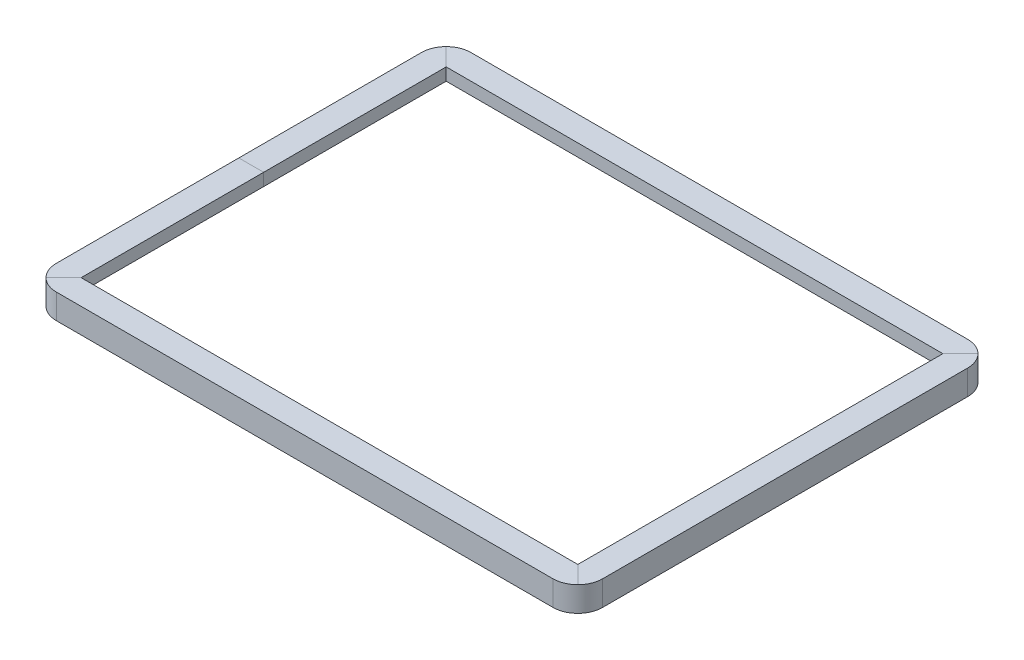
from build123d import *

# Parameters (mm, degrees)
SKETCH12_W         = 10
SKETCH12_H         = 10
SKETCH1_4_W        = 210
SKETCH1_4_H        = 157
CUT_EXTRUDE1_DEPTH = 139.192800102
FILLET1_R          = 10


with BuildPart() as part:
    # Sweep2: sweep along a path in Sketch1
    with BuildLine(Plane(origin=(0, 0, 0), x_dir=(1, 0, 0), z_dir=(0, 1, 0))) as sweep2_path:
        Line((-105, 78.5), (105, 78.5))
        Line((105, 78.5), (105, -78.5))
        Line((105, -78.5), (-105, -78.5))
        Line((-105, -78.5), (-105, 78.5))
    # Sketch12 → Sweep2 (sweep)
    with BuildSketch(Plane.XY):
        with Locations((-105, 0)):
            Rectangle(SKETCH12_W, SKETCH12_H)
    sweep(path=sweep2_path.line, transition=Transition.RIGHT)

    # Sketch1_4 → Cut-Extrude1 (cut, through all)
    with BuildSketch(Plane(origin=(0, 0, 0), x_dir=(1, 0, 0), z_dir=(0, 1, 0))):
        Rectangle(SKETCH1_4_W, SKETCH1_4_H)
    extrude(amount=-CUT_EXTRUDE1_DEPTH, mode=Mode.SUBTRACT)

    # Fillet1
    fillet1_edges = [part.edges().sort_by_distance(p)[0] for p in [
        (-110, 0, 83.5),
        (110, 0, -83.5),
        (-110, 0, -83.5),
        (110, 0, 83.5),
    ]]
    fillet(fillet1_edges, radius=FILLET1_R)


solid = part.part
